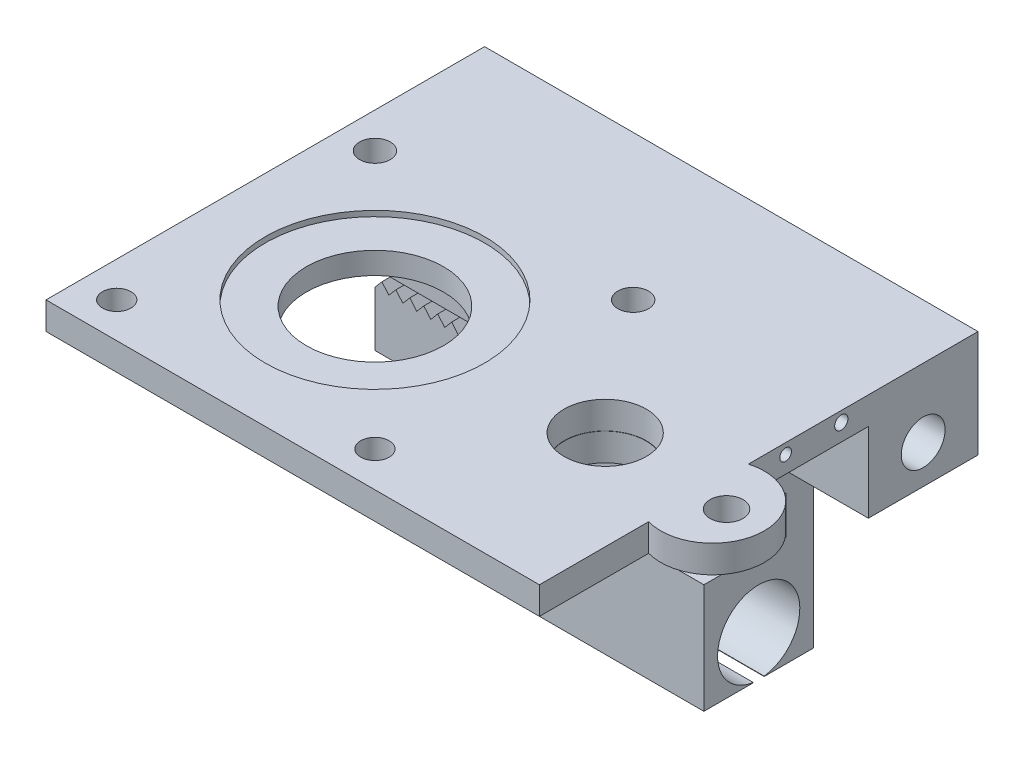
from build123d import *

# Parameters (mm, degrees)
CROQUIS1_W              = 60
CROQUIS1_H              = 60
SALIENTE_EXTRUIR1_DEPTH = 20
CROQUIS2_W              = 10
CROQUIS2_H              = 20
CORTAR_EXTRUIR1_DEPTH   = 88.177978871
CROQUIS3_W              = 5
CROQUIS3_H              = 20
CORTAR_EXTRUIR2_DEPTH   = 88.177978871
CROQUIS4_W              = 15
CROQUIS4_H              = 10
SALIENTE_EXTRUIR2_DEPTH = 60
CROQUIS5_W              = 4
CROQUIS5_H              = 10
CORTAR_EXTRUIR3_DEPTH   = 15
SALIENTE_EXTRUIR3_DEPTH = 15
CROQUIS7_W              = 60
CROQUIS7_H              = 80
SALIENTE_EXTRUIR4_DEPTH = 5
CORTAR_EXTRUIR4_START   = -5
CROQUIS8_R              = 20
CORTAR_EXTRUIR4_DEPTH   = 1
CROQUIS9_R              = 12.5
CORTAR_EXTRUIR5_DEPTH   = 117.619037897
CROQUIS10_R             = 4
SALIENTE_EXTRUIR5_DEPTH = 30
CROQUIS11_R             = 7.5
CORTAR_EXTRUIR6_DEPTH   = 35
CROQUIS12_R             = 12.5
CROQUIS12_R_2           = 7.443528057
SALIENTE_EXTRUIR6_DEPTH = 5
CROQUIS13_R             = 9.448475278
CROQUIS13_R_2           = 3
SALIENTE_EXTRUIR7_DEPTH = 5
CROQUIS14_R             = 1.068583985
CROQUIS14_R_2           = 1.210991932
CORTAR_EXTRUIR7_DEPTH   = 5
CROQUIS15_R             = 2.8
CROQUIS15_R_2           = 2.6
CORTAR_EXTRUIR8_DEPTH   = 20


with BuildPart() as part:
    # Croquis1 → Saliente-Extruir1 (new body)
    with BuildSketch(Plane.XY):
        with Locations((30, 30)):
            Rectangle(CROQUIS1_W, CROQUIS1_H)
    extrude(amount=SALIENTE_EXTRUIR1_DEPTH)

    # Croquis2 → Cortar-Extruir1 (cut, through all)
    with BuildSketch(Plane.ZY):
        with Locations((10, 30)):
            Rectangle(CROQUIS2_W, CROQUIS2_H)
        with BuildLine():
            Line((9, 60), (9, 59.933034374))
            ThreePointArc((9, 59.933034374), (10, 45), (11, 59.933034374))
            Line((11, 59.933034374), (11, 60))
            Line((11, 60), (9, 60))
        make_face()
        with BuildLine():
            Line((11, 0), (11, 0.066965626))
            ThreePointArc((11, 0.066965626), (10, 15), (9, 0.066965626))
            Line((9, 0.066965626), (9, 0))
            Line((9, 0), (11, 0))
        make_face()
    extrude(amount=-CORTAR_EXTRUIR1_DEPTH, mode=Mode.SUBTRACT)

    # Croquis3 → Cortar-Extruir2 (cut, through all)
    with BuildSketch(Plane.ZY):
        with Locations((17.5, 30)):
            Rectangle(CROQUIS3_W, CROQUIS3_H)
    extrude(amount=-CORTAR_EXTRUIR2_DEPTH, mode=Mode.SUBTRACT)

    # Croquis4 → Saliente-Extruir2 (add, through all)
    with BuildSketch(Plane.ZY):
        with Locations((12.5, 32)):
            Rectangle(CROQUIS4_W, CROQUIS4_H)
    extrude(amount=-SALIENTE_EXTRUIR2_DEPTH)

    # Croquis5 → Cortar-Extruir3 (cut)
    with BuildSketch(Plane.XY.offset(20)):
        with Locations((30, 32)):
            Rectangle(CROQUIS5_W, CROQUIS5_H)
    extrude(amount=-CORTAR_EXTRUIR3_DEPTH, mode=Mode.SUBTRACT)

    # Croquis6 → Saliente-Extruir3 (add)
    with BuildSketch(Plane.XY.offset(20)):
        Polygon((0, 37), (2.545454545, 37), (1.272727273, 38.5), align=None)
        Polygon((2.545454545, 37), (5.090909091, 37), (3.818181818, 38.5), align=None)
        Polygon((5.090909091, 37), (7.636363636, 37), (6.363636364, 38.5), align=None)
        Polygon((7.636363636, 37), (10.181818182, 37), (8.909090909, 38.5), align=None)
        Polygon((10.181818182, 37), (12.727272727, 37), (11.454545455, 38.5), align=None)
        Polygon((12.727272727, 37), (15.272727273, 37), (14, 38.5), align=None)
        Polygon((15.272727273, 37), (17.818181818, 37), (16.545454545, 38.5), align=None)
        Polygon((17.818181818, 37), (20.363636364, 37), (19.090909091, 38.5), align=None)
        Polygon((20.363636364, 37), (22.909090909, 37), (21.636363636, 38.5), align=None)
        Polygon((22.909090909, 37), (25.454545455, 37), (24.181818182, 38.5), align=None)
        Polygon((25.454545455, 37), (28, 37), (26.727272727, 38.5), align=None)
    saliente_extruir3 = extrude(amount=-SALIENTE_EXTRUIR3_DEPTH)

    # Simetr_a1: Saliente-Extruir3 across plane
    add(saliente_extruir3.mirror(Plane.ZY.offset(-30)))

    # Croquis7 → Saliente-Extruir4 (add)
    with BuildSketch(Plane(origin=(0, 60, 0), x_dir=(1, 0, 0), z_dir=(0, 1, 0))):
        with Locations((30, -40)):
            Rectangle(CROQUIS7_W, CROQUIS7_H)
    extrude(amount=SALIENTE_EXTRUIR4_DEPTH)

    # Croquis8 → Cortar-Extruir4 (cut)
    with BuildSketch(Plane.XZ.offset(-60).offset(CORTAR_EXTRUIR4_START)):
        with Locations(Location((30, 50, 0), (0, 0, 90))):
            Circle(CROQUIS8_R)
    extrude(amount=CORTAR_EXTRUIR4_DEPTH, mode=Mode.SUBTRACT)

    # Croquis9 → Cortar-Extruir5 (cut, through all)
    with BuildSketch(Plane.XZ.offset(-60)):
        with Locations(Location((30, 50, 0), (0, 0, 270))):
            Circle(CROQUIS9_R)
    extrude(amount=-CORTAR_EXTRUIR5_DEPTH, mode=Mode.SUBTRACT)

    # Croquis10 → Saliente-Extruir5 (add)
    with BuildSketch(Plane(origin=(60, 0, 0), x_dir=(0, 0, -1), z_dir=(1, 0, 0))):
        Polygon((0, 45.487363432), (-20, 45.5), (-20, 60), (-80, 60), (-80, 65), (0, 65), align=None)
        with Locations((-10, 52.5)):
            Circle(CROQUIS10_R, mode=Mode.SUBTRACT)
    extrude(amount=SALIENTE_EXTRUIR5_DEPTH)

    # Croquis11 → Cortar-Extruir6 (cut)
    with BuildSketch(Plane(origin=(0, 65, 0), x_dir=(1, 0, 0), z_dir=(0, 1, 0))):
        with Locations(Location((72, -50, 0), (0, 0, 270))):
            Circle(CROQUIS11_R)
    extrude(amount=-CORTAR_EXTRUIR6_DEPTH, mode=Mode.SUBTRACT)

    # Croquis12 → Saliente-Extruir6 (add)
    with BuildSketch(Plane.XZ.offset(-60)):
        with Locations(Location((72, 50, 0), (0, 0, 90))):
            Circle(CROQUIS12_R)
        with Locations(Location((72, 50, 0), (0, 0, 270))):
            Circle(CROQUIS12_R_2, mode=Mode.SUBTRACT)
    extrude(amount=SALIENTE_EXTRUIR6_DEPTH)

    # Croquis13 → Saliente-Extruir7 (add)
    with BuildSketch(Plane(origin=(0, 65, 0), x_dir=(1, 0, 0), z_dir=(0, 1, 0))):
        with Locations((92.546680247, -50.974782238)):
            Circle(CROQUIS13_R)
        with Locations(Location((95.109714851, -50.974782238, 0), (0, 0, 270))):
            Circle(CROQUIS13_R_2, mode=Mode.SUBTRACT)
    extrude(amount=-SALIENTE_EXTRUIR7_DEPTH)

    # Croquis14 → Cortar-Extruir7 (cut)
    with BuildSketch(Plane(origin=(90, 0, 0), x_dir=(0, 0, -1), z_dir=(1, 0, 0))):
        with Locations((-35.090028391, 63.108282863)):
            Circle(CROQUIS14_R)
        with Locations((-24.93031236, 63.108282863)):
            Circle(CROQUIS14_R_2)
    extrude(amount=-CORTAR_EXTRUIR7_DEPTH, mode=Mode.SUBTRACT)

    # Croquis15 → Cortar-Extruir8 (cut)
    with BuildSketch(Plane(origin=(0, 65, 0), x_dir=(1, 0, 0), z_dir=(0, 1, 0))):
        with Locations(Location((6.45, -26.45, 0), (0, 0, 270))):
            Circle(CROQUIS15_R)
        with Locations(Location((53.55, -26.45, 0), (0, 0, 270))):
            Circle(CROQUIS15_R)
        with Locations(Location((6.45, -73.55, 0), (0, 0, 270))):
            Circle(CROQUIS15_R_2)
        with Locations(Location((53.55, -73.55, 0), (0, 0, 270))):
            Circle(CROQUIS15_R_2)
    extrude(amount=-CORTAR_EXTRUIR8_DEPTH, mode=Mode.SUBTRACT)


solid = part.part
